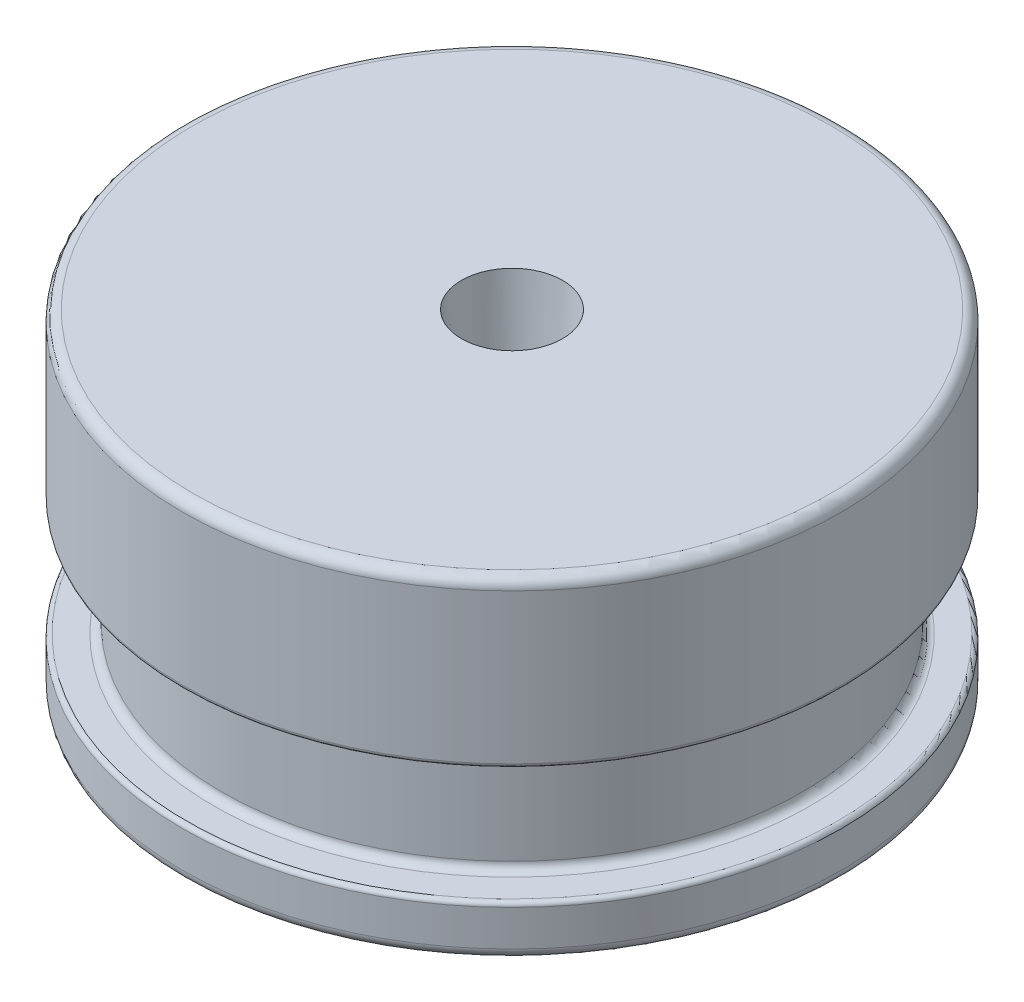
from build123d import *

# Parameters (mm, degrees)
FILLET3_R          = 0.381
SKETCH2_R          = 15.5575
EXTRUDE2_DEPTH     = 2.3622
EXTRUDE3_START     = -15.657085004
SKETCH3_R          = 12.7
SKETCH3_R_2        = 1.7272
EXTRUDE3_DEPTH     = 15.657085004
FILLET4_R          = 0.508
EXTRUDE4_START     = 6.6802
SKETCH5_R          = 14.54404
EXTRUDE4_DEPTH     = 6.6802
SKETCH4_R          = 1.7272
CUT_EXTRUDE1_DEPTH = 28.003998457
SKETCH7_R          = 3.175
FILLET5_R          = 0.2032


with BuildPart() as part:
    # Sketch1 → Revolve1 (revolve)
    with BuildSketch(Plane.XY, mode=Mode.PRIVATE) as revolve1_sk:
        Polygon((1.7272, 0), (1.7272, 1.27), (11.43, 2.118885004), (12.7, 2.118885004), (12.7, 8.976885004), (14.54404, 8.976885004), (14.54404, 9.992885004), (13.73124, 9.992885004), (13.73124, 13.294885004), (15.5575, 13.294885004), (15.5575, 7.874), (13.716, 7.874), (13.716, 2.413), (15.5575, 2.413), (15.5575, 0), align=None)
    revolve(revolve1_sk.sketch.rotate(Axis((0, 19.743238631, 0), (0, -1, 0)), 90), axis=Axis((0, 19.743238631, 0), (0, -1, 0)))

    # Fillet3
    fillet3_edges = [part.edges().sort_by_distance(p)[0] for p in [
        (0, 7.874, -13.716),
        (0, 2.413, -13.716),
    ]]
    fillet(fillet3_edges, radius=FILLET3_R)

    # Sketch2 → Extrude2 (add)
    with BuildSketch(Plane(origin=(0, 13.294885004, 0), x_dir=(-1, 0, 0), z_dir=(0, 1, 0))):
        with Locations(Location((0, 0, 0), (0, 0, 90))):
            Circle(SKETCH2_R)
    extrude(amount=EXTRUDE2_DEPTH)

    # Sketch3 → Extrude3 (add)
    with BuildSketch(Plane.XZ.offset(EXTRUDE3_START)):
        with Locations(Location((0, 0, 0), (0, 0, 90))):
            Circle(SKETCH3_R)
        with Locations(Location((0, 0, 0), (0, 0, 90))):
            Circle(SKETCH3_R_2, mode=Mode.SUBTRACT)
    extrude(amount=EXTRUDE3_DEPTH)

    # Fillet4
    fillet4_edges = [part.edges().sort_by_distance(p)[0] for p in [
        (0, 0, -15.5575),
        (0, 15.657085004, -15.5575),
    ]]
    fillet(fillet4_edges, radius=FILLET4_R)

    # Sketch5 → Extrude4 (add)
    with BuildSketch(Plane(origin=(0, 8.976885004, 0), x_dir=(-1, 0, 0), z_dir=(0, 1, 0)).offset(EXTRUDE4_START)):
        Circle(SKETCH5_R)
    extrude(amount=-EXTRUDE4_DEPTH)

    # Sketch4 → Cut-Extrude1 (cut, through all)
    with BuildSketch(Plane.XZ):
        with Locations(Location((0, 0, 0), (0, 0, 90))):
            Circle(SKETCH4_R)
    extrude(amount=-CUT_EXTRUDE1_DEPTH, mode=Mode.SUBTRACT)

    # Sketch7 → Cut-Revolve1 (revolve, cut)
    with BuildSketch(Plane.XY, mode=Mode.PRIVATE) as cut_revolve1_sk:
        with Locations((10.414, -1.868914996)):
            Circle(SKETCH7_R)
    revolve(cut_revolve1_sk.sketch.rotate(Axis((0, 0, 0), (0, 1, 0)), 90), axis=Axis((0, 0, 0), (0, 1, 0)), mode=Mode.SUBTRACT)

    # Fillet5
    fillet5_edges = [part.edges().sort_by_distance(p)[0] for p in [
        (0, 7.874, -15.5575),
        (0, 2.413, -15.5575),
    ]]
    fillet(fillet5_edges, radius=FILLET5_R)

    # Sketch8 → Cut-Revolve2 (revolve, cut)
    with BuildSketch(Plane.XY, mode=Mode.PRIVATE) as cut_revolve2_sk:
        Polygon((1.7272, 15.657085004), (2.3876, 15.657085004), (1.7272, 8.108678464), align=None)
    revolve(cut_revolve2_sk.sketch.rotate(Axis((0, 0, 0), (0, 1, 0)), 90), axis=Axis((0, 0, 0), (0, 1, 0)), mode=Mode.SUBTRACT)


solid = part.part
